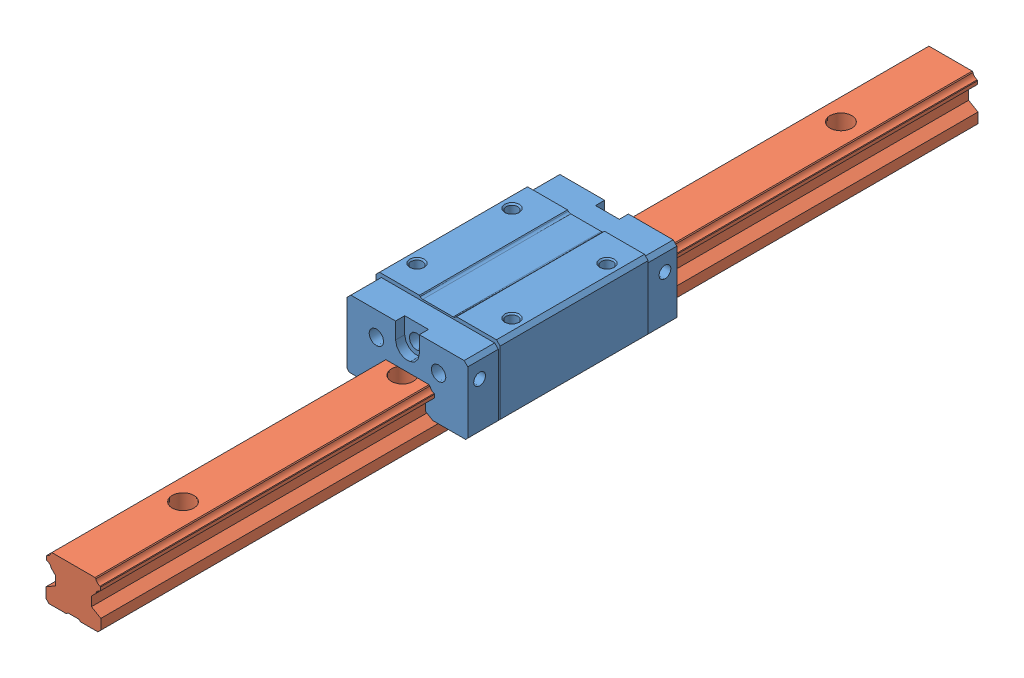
SolidWorks assembly IAS01-H24-L240.sldasm, configuration Default (file format 13000). Lengths in mm.
Overall size (34 24 240).
2 component instances, 2 part files, 0 mates.
Components (placement in the parent):
- ELH15CA-1: ELH15CA.SLDPRT [Default] at (0 24 -91.4) size (34 19.5 57.2)
- ELR15R240 E=30-1: ELR15R240 E=30.SLDPRT [Default] at (0 24 0) size (15 12.5 240)
